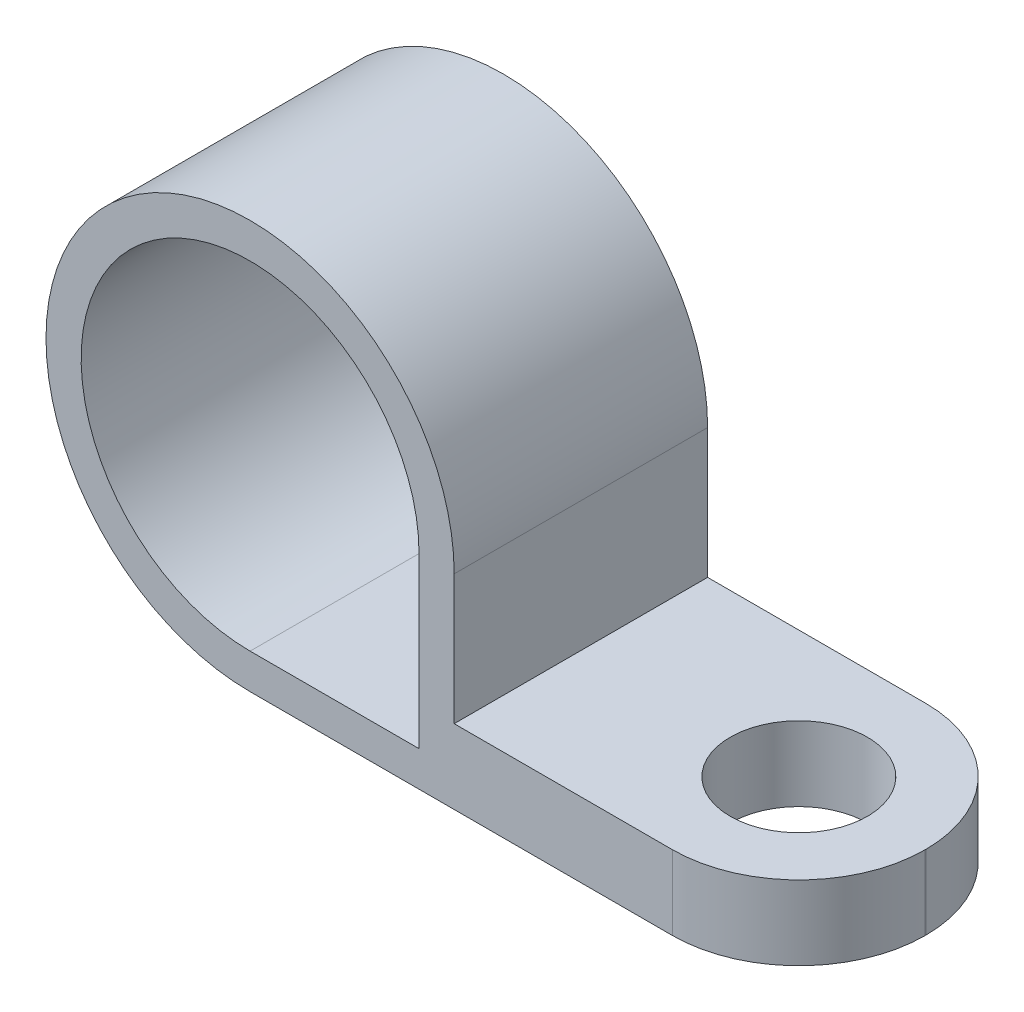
ISO-10303-21;
HEADER;
FILE_DESCRIPTION(('STEP AP214'),'2;1');
FILE_NAME('part.step','',(''),(''),'','','');
FILE_SCHEMA(('AUTOMOTIVE_DESIGN { 1 0 10303 214 1 1 1 1 }'));
ENDSEC;
DATA;
#1=APPLICATION_CONTEXT('core data for automotive mechanical design processes');
#2=APPLICATION_PROTOCOL_DEFINITION('international standard','automotive_design',2000,#1);
#3=PRODUCT_CONTEXT('',#1,'mechanical');
#4=PRODUCT('Part','Part','',(#3));
#5=PRODUCT_RELATED_PRODUCT_CATEGORY('part','',(#4));
#6=PRODUCT_DEFINITION_FORMATION('','',#4);
#7=PRODUCT_DEFINITION_CONTEXT('part definition',#1,'design');
#8=PRODUCT_DEFINITION('design','',#6,#7);
#9=PRODUCT_DEFINITION_SHAPE('','',#8);
#10=(LENGTH_UNIT() NAMED_UNIT(*) SI_UNIT(.MILLI.,.METRE.));
#11=(NAMED_UNIT(*) PLANE_ANGLE_UNIT() SI_UNIT($,.RADIAN.));
#12=(NAMED_UNIT(*) SI_UNIT($,.STERADIAN.) SOLID_ANGLE_UNIT());
#13=UNCERTAINTY_MEASURE_WITH_UNIT(LENGTH_MEASURE(1.E-05),#10,'distance_accuracy_value','');
#14=(GEOMETRIC_REPRESENTATION_CONTEXT(3) GLOBAL_UNCERTAINTY_ASSIGNED_CONTEXT((#13)) GLOBAL_UNIT_ASSIGNED_CONTEXT((#10,
#11,#12)) REPRESENTATION_CONTEXT('',''));
#15=CARTESIAN_POINT('',(0.,0.,0.));
#16=DIRECTION('',(0.,0.,1.));
#17=DIRECTION('',(1.,0.,0.));
#18=AXIS2_PLACEMENT_3D('',#15,#16,#17);
#19=CARTESIAN_POINT('',(0.,0.,4.7625));
#20=DIRECTION('',(0.,0.,1.));
#21=DIRECTION('',(1.,0.,0.));
#22=AXIS2_PLACEMENT_3D('',#19,#20,#21);
#23=PLANE('',#22);
#24=DIRECTION('',(1.,0.,0.));
#25=VECTOR('',#24,1.);
#26=CARTESIAN_POINT('',(0.,-7.6708,4.7625));
#27=LINE('',#26,#25);
#28=CARTESIAN_POINT('',(0.,-7.6708,4.7625));
#29=VERTEX_POINT('',#28);
#30=CARTESIAN_POINT('',(15.875,-7.6708,4.7625));
#31=VERTEX_POINT('',#30);
#32=EDGE_CURVE('E510',#29,#31,#27,.T.);
#33=ORIENTED_EDGE('',*,*,#32,.T.);
#34=DIRECTION('',(0.,1.,0.));
#35=VECTOR('',#34,1.);
#36=CARTESIAN_POINT('',(15.875,-4.8768,4.7625));
#37=LINE('',#36,#35);
#38=CARTESIAN_POINT('',(15.875,-4.8768,4.7625));
#39=VERTEX_POINT('',#38);
#40=EDGE_CURVE('E11',#31,#39,#37,.T.);
#41=ORIENTED_EDGE('',*,*,#40,.T.);
#42=DIRECTION('',(-1.,0.,0.));
#43=VECTOR('',#42,1.);
#44=CARTESIAN_POINT('',(7.6708,-4.8768,4.7625));
#45=LINE('',#44,#43);
#46=CARTESIAN_POINT('',(7.6708,-4.8768,4.7625));
#47=VERTEX_POINT('',#46);
#48=EDGE_CURVE('E512',#39,#47,#45,.T.);
#49=ORIENTED_EDGE('',*,*,#48,.T.);
#50=DIRECTION('',(0.,1.,0.));
#51=VECTOR('',#50,1.);
#52=CARTESIAN_POINT('',(7.6708,0.,4.7625));
#53=LINE('',#52,#51);
#54=CARTESIAN_POINT('',(7.6708,0.,4.7625));
#55=VERTEX_POINT('',#54);
#56=EDGE_CURVE('E514',#47,#55,#53,.T.);
#57=ORIENTED_EDGE('',*,*,#56,.T.);
#58=CARTESIAN_POINT('',(0.,0.,4.7625));
#59=DIRECTION('',(0.,0.,1.));
#60=DIRECTION('',(1.,0.,0.));
#61=AXIS2_PLACEMENT_3D('',#58,#59,#60);
#62=CIRCLE('',#61,7.6708);
#63=EDGE_CURVE('E507',#55,#29,#62,.T.);
#64=ORIENTED_EDGE('',*,*,#63,.T.);
#65=EDGE_LOOP('',(#33,#41,#49,#57,#64));
#66=FACE_BOUND('',#65,.T.);
#67=DIRECTION('',(1.,0.,0.));
#68=VECTOR('',#67,1.);
#69=CARTESIAN_POINT('',(6.35,-6.35,4.7625));
#70=LINE('',#69,#68);
#71=CARTESIAN_POINT('',(0.,-6.35,4.7625));
#72=VERTEX_POINT('',#71);
#73=CARTESIAN_POINT('',(6.35,-6.35,4.7625));
#74=VERTEX_POINT('',#73);
#75=EDGE_CURVE('E492',#72,#74,#70,.T.);
#76=ORIENTED_EDGE('',*,*,#75,.F.);
#77=CARTESIAN_POINT('',(0.,0.,4.7625));
#78=DIRECTION('',(0.,0.,1.));
#79=DIRECTION('',(1.,0.,0.));
#80=AXIS2_PLACEMENT_3D('',#77,#78,#79);
#81=CIRCLE('',#80,6.35);
#82=CARTESIAN_POINT('',(6.35,0.,4.7625));
#83=VERTEX_POINT('',#82);
#84=EDGE_CURVE('E479',#83,#72,#81,.T.);
#85=ORIENTED_EDGE('',*,*,#84,.F.);
#86=DIRECTION('',(0.,1.,0.));
#87=VECTOR('',#86,1.);
#88=CARTESIAN_POINT('',(6.35,0.,4.7625));
#89=LINE('',#88,#87);
#90=EDGE_CURVE('E494',#74,#83,#89,.T.);
#91=ORIENTED_EDGE('',*,*,#90,.F.);
#92=EDGE_LOOP('',(#76,#85,#91));
#93=FACE_BOUND('',#92,.T.);
#94=ADVANCED_FACE('F381',(#66,#93),#23,.T.);
#95=CARTESIAN_POINT('',(0.,0.,-4.7625));
#96=DIRECTION('',(0.,0.,1.));
#97=DIRECTION('',(1.,0.,0.));
#98=AXIS2_PLACEMENT_3D('',#95,#96,#97);
#99=PLANE('',#98);
#100=DIRECTION('',(-1.,0.,0.));
#101=VECTOR('',#100,1.);
#102=CARTESIAN_POINT('',(7.6708,-4.8768,-4.7625));
#103=LINE('',#102,#101);
#104=CARTESIAN_POINT('',(15.875,-4.8768,-4.7625));
#105=VERTEX_POINT('',#104);
#106=CARTESIAN_POINT('',(7.6708,-4.8768,-4.7625));
#107=VERTEX_POINT('',#106);
#108=EDGE_CURVE('E503',#105,#107,#103,.T.);
#109=ORIENTED_EDGE('',*,*,#108,.F.);
#110=DIRECTION('',(0.,1.,0.));
#111=VECTOR('',#110,1.);
#112=CARTESIAN_POINT('',(15.875,0.,-4.7625));
#113=LINE('',#112,#111);
#114=CARTESIAN_POINT('',(15.875,-7.6708,-4.7625));
#115=VERTEX_POINT('',#114);
#116=EDGE_CURVE('E404',#105,#115,#113,.F.);
#117=ORIENTED_EDGE('',*,*,#116,.T.);
#118=DIRECTION('',(1.,0.,0.));
#119=VECTOR('',#118,1.);
#120=CARTESIAN_POINT('',(0.,-7.6708,-4.7625));
#121=LINE('',#120,#119);
#122=CARTESIAN_POINT('',(0.,-7.6708,-4.7625));
#123=VERTEX_POINT('',#122);
#124=EDGE_CURVE('E501',#123,#115,#121,.T.);
#125=ORIENTED_EDGE('',*,*,#124,.F.);
#126=CARTESIAN_POINT('',(0.,0.,-4.7625));
#127=DIRECTION('',(0.,0.,1.));
#128=DIRECTION('',(1.,0.,0.));
#129=AXIS2_PLACEMENT_3D('',#126,#127,#128);
#130=CIRCLE('',#129,7.6708);
#131=CARTESIAN_POINT('',(7.6708,0.,-4.7625));
#132=VERTEX_POINT('',#131);
#133=EDGE_CURVE('E480',#132,#123,#130,.T.);
#134=ORIENTED_EDGE('',*,*,#133,.F.);
#135=DIRECTION('',(0.,1.,0.));
#136=VECTOR('',#135,1.);
#137=CARTESIAN_POINT('',(7.6708,0.,-4.7625));
#138=LINE('',#137,#136);
#139=EDGE_CURVE('E505',#107,#132,#138,.T.);
#140=ORIENTED_EDGE('',*,*,#139,.F.);
#141=EDGE_LOOP('',(#109,#117,#125,#134,#140));
#142=FACE_BOUND('',#141,.T.);
#143=CARTESIAN_POINT('',(0.,0.,-4.7625));
#144=DIRECTION('',(0.,0.,1.));
#145=DIRECTION('',(1.,0.,0.));
#146=AXIS2_PLACEMENT_3D('',#143,#144,#145);
#147=CIRCLE('',#146,6.35);
#148=CARTESIAN_POINT('',(6.35,0.,-4.7625));
#149=VERTEX_POINT('',#148);
#150=CARTESIAN_POINT('',(0.,-6.35,-4.7625));
#151=VERTEX_POINT('',#150);
#152=EDGE_CURVE('E472',#149,#151,#147,.T.);
#153=ORIENTED_EDGE('',*,*,#152,.T.);
#154=DIRECTION('',(1.,0.,0.));
#155=VECTOR('',#154,1.);
#156=CARTESIAN_POINT('',(6.35,-6.35,-4.7625));
#157=LINE('',#156,#155);
#158=CARTESIAN_POINT('',(6.35,-6.35,-4.7625));
#159=VERTEX_POINT('',#158);
#160=EDGE_CURVE('E460',#151,#159,#157,.T.);
#161=ORIENTED_EDGE('',*,*,#160,.T.);
#162=DIRECTION('',(0.,1.,0.));
#163=VECTOR('',#162,1.);
#164=CARTESIAN_POINT('',(6.35,0.,-4.7625));
#165=LINE('',#164,#163);
#166=EDGE_CURVE('E471',#159,#149,#165,.T.);
#167=ORIENTED_EDGE('',*,*,#166,.T.);
#168=EDGE_LOOP('',(#153,#161,#167));
#169=FACE_BOUND('',#168,.T.);
#170=ADVANCED_FACE('F482',(#142,#169),#99,.F.);
#171=CARTESIAN_POINT('',(0.,0.,4.7625));
#172=DIRECTION('',(0.,0.,-1.));
#173=DIRECTION('',(-1.,0.,0.));
#174=AXIS2_PLACEMENT_3D('',#171,#172,#173);
#175=CYLINDRICAL_SURFACE('',#174,7.6708);
#176=ORIENTED_EDGE('',*,*,#133,.T.);
#177=DIRECTION('',(0.,0.,-1.));
#178=VECTOR('',#177,1.);
#179=CARTESIAN_POINT('',(0.,-7.6708,4.7625));
#180=LINE('',#179,#178);
#181=EDGE_CURVE('E528',#29,#123,#180,.T.);
#182=ORIENTED_EDGE('',*,*,#181,.F.);
#183=ORIENTED_EDGE('',*,*,#63,.F.);
#184=DIRECTION('',(0.,0.,-1.));
#185=VECTOR('',#184,1.);
#186=CARTESIAN_POINT('',(7.6708,0.,4.7625));
#187=LINE('',#186,#185);
#188=EDGE_CURVE('E516',#55,#132,#187,.T.);
#189=ORIENTED_EDGE('',*,*,#188,.T.);
#190=EDGE_LOOP('',(#176,#182,#183,#189));
#191=FACE_BOUND('',#190,.T.);
#192=ADVANCED_FACE('F383',(#191),#175,.T.);
#193=CARTESIAN_POINT('',(0.,-7.6708,4.7625));
#194=DIRECTION('',(0.,1.,0.));
#195=DIRECTION('',(0.,0.,1.));
#196=AXIS2_PLACEMENT_3D('',#193,#194,#195);
#197=PLANE('',#196);
#198=CARTESIAN_POINT('',(15.875,-7.6708,0.0127));
#199=DIRECTION('',(0.,1.,0.));
#200=DIRECTION('',(0.,0.,1.));
#201=AXIS2_PLACEMENT_3D('',#198,#199,#200);
#202=CIRCLE('',#201,2.5781);
#203=CARTESIAN_POINT('',(15.875,-7.6708,2.5908));
#204=VERTEX_POINT('',#203);
#205=EDGE_CURVE('E483',#204,#204,#202,.T.);
#206=ORIENTED_EDGE('',*,*,#205,.T.);
#207=EDGE_LOOP('',(#206));
#208=FACE_BOUND('',#207,.T.);
#209=ORIENTED_EDGE('',*,*,#124,.T.);
#210=CARTESIAN_POINT('',(15.875,-7.6708,-0.0127));
#211=DIRECTION('',(0.,1.,0.));
#212=DIRECTION('',(0.,0.,1.));
#213=AXIS2_PLACEMENT_3D('',#210,#211,#212);
#214=CIRCLE('',#213,4.7498);
#215=CARTESIAN_POINT('',(20.6248,-7.6708,-0.0126999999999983));
#216=VERTEX_POINT('',#215);
#217=EDGE_CURVE('E389',#115,#216,#214,.F.);
#218=ORIENTED_EDGE('',*,*,#217,.T.);
#219=DIRECTION('',(0.,0.,-1.));
#220=VECTOR('',#219,1.);
#221=CARTESIAN_POINT('',(20.6248,-7.6708,4.7625));
#222=LINE('',#221,#220);
#223=CARTESIAN_POINT('',(20.6248,-7.6708,0.0127000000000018));
#224=VERTEX_POINT('',#223);
#225=EDGE_CURVE('E525',#224,#216,#222,.T.);
#226=ORIENTED_EDGE('',*,*,#225,.F.);
#227=CARTESIAN_POINT('',(15.875,-7.6708,0.0127));
#228=DIRECTION('',(0.,1.,0.));
#229=DIRECTION('',(0.,0.,1.));
#230=AXIS2_PLACEMENT_3D('',#227,#228,#229);
#231=CIRCLE('',#230,4.7498);
#232=EDGE_CURVE('E396',#224,#31,#231,.F.);
#233=ORIENTED_EDGE('',*,*,#232,.T.);
#234=ORIENTED_EDGE('',*,*,#32,.F.);
#235=ORIENTED_EDGE('',*,*,#181,.T.);
#236=EDGE_LOOP('',(#209,#218,#226,#233,#234,#235));
#237=FACE_BOUND('',#236,.T.);
#238=ADVANCED_FACE('F542',(#208,#237),#197,.F.);
#239=CARTESIAN_POINT('',(20.6248,-4.8768,4.7625));
#240=DIRECTION('',(-1.,0.,0.));
#241=DIRECTION('',(0.,0.,1.));
#242=AXIS2_PLACEMENT_3D('',#239,#240,#241);
#243=PLANE('',#242);
#244=ORIENTED_EDGE('',*,*,#225,.T.);
#245=DIRECTION('',(0.,1.,0.));
#246=VECTOR('',#245,1.);
#247=CARTESIAN_POINT('',(20.6248,-4.8768,-0.0127));
#248=LINE('',#247,#246);
#249=CARTESIAN_POINT('',(20.6248,-4.8768,-0.0126999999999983));
#250=VERTEX_POINT('',#249);
#251=EDGE_CURVE('E533',#216,#250,#248,.T.);
#252=ORIENTED_EDGE('',*,*,#251,.T.);
#253=DIRECTION('',(0.,0.,-1.));
#254=VECTOR('',#253,1.);
#255=CARTESIAN_POINT('',(20.6248,-4.8768,4.7625));
#256=LINE('',#255,#254);
#257=CARTESIAN_POINT('',(20.6248,-4.8768,0.0127000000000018));
#258=VERTEX_POINT('',#257);
#259=EDGE_CURVE('E522',#258,#250,#256,.T.);
#260=ORIENTED_EDGE('',*,*,#259,.F.);
#261=DIRECTION('',(0.,1.,0.));
#262=VECTOR('',#261,1.);
#263=CARTESIAN_POINT('',(20.6248,-7.6708,0.0127));
#264=LINE('',#263,#262);
#265=EDGE_CURVE('E531',#258,#224,#264,.F.);
#266=ORIENTED_EDGE('',*,*,#265,.T.);
#267=EDGE_LOOP('',(#244,#252,#260,#266));
#268=FACE_BOUND('',#267,.T.);
#269=ADVANCED_FACE('F546',(#268),#243,.F.);
#270=CARTESIAN_POINT('',(7.6708,-4.8768,4.7625));
#271=DIRECTION('',(0.,-1.,0.));
#272=DIRECTION('',(1.,0.,0.));
#273=AXIS2_PLACEMENT_3D('',#270,#271,#272);
#274=PLANE('',#273);
#275=CARTESIAN_POINT('',(15.875,-4.8768,0.0127));
#276=DIRECTION('',(0.,1.,0.));
#277=DIRECTION('',(0.,0.,1.));
#278=AXIS2_PLACEMENT_3D('',#275,#276,#277);
#279=CIRCLE('',#278,2.5781);
#280=CARTESIAN_POINT('',(15.875,-4.8768,2.5908));
#281=VERTEX_POINT('',#280);
#282=EDGE_CURVE('E486',#281,#281,#279,.T.);
#283=ORIENTED_EDGE('',*,*,#282,.F.);
#284=EDGE_LOOP('',(#283));
#285=FACE_BOUND('',#284,.T.);
#286=ORIENTED_EDGE('',*,*,#259,.T.);
#287=CARTESIAN_POINT('',(15.875,-4.8768,-0.0127));
#288=DIRECTION('',(0.,-1.,0.));
#289=DIRECTION('',(1.,0.,0.));
#290=AXIS2_PLACEMENT_3D('',#287,#288,#289);
#291=CIRCLE('',#290,4.7498);
#292=EDGE_CURVE('E538',#250,#105,#291,.F.);
#293=ORIENTED_EDGE('',*,*,#292,.T.);
#294=ORIENTED_EDGE('',*,*,#108,.T.);
#295=DIRECTION('',(0.,0.,-1.));
#296=VECTOR('',#295,1.);
#297=CARTESIAN_POINT('',(7.6708,-4.8768,4.7625));
#298=LINE('',#297,#296);
#299=EDGE_CURVE('E519',#47,#107,#298,.T.);
#300=ORIENTED_EDGE('',*,*,#299,.F.);
#301=ORIENTED_EDGE('',*,*,#48,.F.);
#302=CARTESIAN_POINT('',(15.875,-4.8768,0.0127));
#303=DIRECTION('',(0.,-1.,0.));
#304=DIRECTION('',(1.,0.,0.));
#305=AXIS2_PLACEMENT_3D('',#302,#303,#304);
#306=CIRCLE('',#305,4.7498);
#307=EDGE_CURVE('E536',#39,#258,#306,.F.);
#308=ORIENTED_EDGE('',*,*,#307,.T.);
#309=EDGE_LOOP('',(#286,#293,#294,#300,#301,#308));
#310=FACE_BOUND('',#309,.T.);
#311=ADVANCED_FACE('F551',(#285,#310),#274,.F.);
#312=CARTESIAN_POINT('',(7.6708,0.,4.7625));
#313=DIRECTION('',(-1.,0.,0.));
#314=DIRECTION('',(0.,-1.,0.));
#315=AXIS2_PLACEMENT_3D('',#312,#313,#314);
#316=PLANE('',#315);
#317=ORIENTED_EDGE('',*,*,#139,.T.);
#318=ORIENTED_EDGE('',*,*,#188,.F.);
#319=ORIENTED_EDGE('',*,*,#56,.F.);
#320=ORIENTED_EDGE('',*,*,#299,.T.);
#321=EDGE_LOOP('',(#317,#318,#319,#320));
#322=FACE_BOUND('',#321,.T.);
#323=ADVANCED_FACE('F557',(#322),#316,.F.);
#324=CARTESIAN_POINT('',(0.,0.,4.7625));
#325=DIRECTION('',(0.,0.,-1.));
#326=DIRECTION('',(-1.,0.,0.));
#327=AXIS2_PLACEMENT_3D('',#324,#325,#326);
#328=CYLINDRICAL_SURFACE('',#327,6.35);
#329=ORIENTED_EDGE('',*,*,#152,.F.);
#330=DIRECTION('',(0.,0.,-1.));
#331=VECTOR('',#330,1.);
#332=CARTESIAN_POINT('',(6.35,0.,4.7625));
#333=LINE('',#332,#331);
#334=EDGE_CURVE('E496',#83,#149,#333,.T.);
#335=ORIENTED_EDGE('',*,*,#334,.F.);
#336=ORIENTED_EDGE('',*,*,#84,.T.);
#337=DIRECTION('',(0.,0.,-1.));
#338=VECTOR('',#337,1.);
#339=CARTESIAN_POINT('',(0.,-6.35,4.7625));
#340=LINE('',#339,#338);
#341=EDGE_CURVE('E464',#72,#151,#340,.T.);
#342=ORIENTED_EDGE('',*,*,#341,.T.);
#343=EDGE_LOOP('',(#329,#335,#336,#342));
#344=FACE_BOUND('',#343,.T.);
#345=ADVANCED_FACE('F475',(#344),#328,.F.);
#346=CARTESIAN_POINT('',(6.35,-6.35,4.7625));
#347=DIRECTION('',(0.,1.,0.));
#348=DIRECTION('',(-1.,0.,0.));
#349=AXIS2_PLACEMENT_3D('',#346,#347,#348);
#350=PLANE('',#349);
#351=ORIENTED_EDGE('',*,*,#160,.F.);
#352=ORIENTED_EDGE('',*,*,#341,.F.);
#353=ORIENTED_EDGE('',*,*,#75,.T.);
#354=DIRECTION('',(0.,0.,-1.));
#355=VECTOR('',#354,1.);
#356=CARTESIAN_POINT('',(6.35,-6.35,4.7625));
#357=LINE('',#356,#355);
#358=EDGE_CURVE('E466',#74,#159,#357,.T.);
#359=ORIENTED_EDGE('',*,*,#358,.T.);
#360=EDGE_LOOP('',(#351,#352,#353,#359));
#361=FACE_BOUND('',#360,.T.);
#362=ADVANCED_FACE('F462',(#361),#350,.T.);
#363=CARTESIAN_POINT('',(6.35,0.,4.7625));
#364=DIRECTION('',(-1.,0.,0.));
#365=DIRECTION('',(0.,-1.,0.));
#366=AXIS2_PLACEMENT_3D('',#363,#364,#365);
#367=PLANE('',#366);
#368=ORIENTED_EDGE('',*,*,#166,.F.);
#369=ORIENTED_EDGE('',*,*,#358,.F.);
#370=ORIENTED_EDGE('',*,*,#90,.T.);
#371=ORIENTED_EDGE('',*,*,#334,.T.);
#372=EDGE_LOOP('',(#368,#369,#370,#371));
#373=FACE_BOUND('',#372,.T.);
#374=ADVANCED_FACE('F578',(#373),#367,.T.);
#375=CARTESIAN_POINT('',(15.875,-4.8768,-0.0127));
#376=DIRECTION('',(0.,1.,0.));
#377=DIRECTION('',(0.,0.,1.));
#378=AXIS2_PLACEMENT_3D('',#375,#376,#377);
#379=CYLINDRICAL_SURFACE('',#378,4.7498);
#380=ORIENTED_EDGE('',*,*,#217,.F.);
#381=ORIENTED_EDGE('',*,*,#116,.F.);
#382=ORIENTED_EDGE('',*,*,#292,.F.);
#383=ORIENTED_EDGE('',*,*,#251,.F.);
#384=EDGE_LOOP('',(#380,#381,#382,#383));
#385=FACE_BOUND('',#384,.T.);
#386=ADVANCED_FACE('F549',(#385),#379,.T.);
#387=CARTESIAN_POINT('',(15.875,0.,0.0127));
#388=DIRECTION('',(0.,-1.,0.));
#389=DIRECTION('',(0.,0.,-1.));
#390=AXIS2_PLACEMENT_3D('',#387,#388,#389);
#391=CYLINDRICAL_SURFACE('',#390,4.7498);
#392=ORIENTED_EDGE('',*,*,#232,.F.);
#393=ORIENTED_EDGE('',*,*,#265,.F.);
#394=ORIENTED_EDGE('',*,*,#307,.F.);
#395=ORIENTED_EDGE('',*,*,#40,.F.);
#396=EDGE_LOOP('',(#392,#393,#394,#395));
#397=FACE_BOUND('',#396,.T.);
#398=ADVANCED_FACE('F567',(#397),#391,.T.);
#399=CARTESIAN_POINT('',(15.875,-7.6708,0.0127));
#400=DIRECTION('',(0.,1.,0.));
#401=DIRECTION('',(0.,0.,1.));
#402=AXIS2_PLACEMENT_3D('',#399,#400,#401);
#403=CYLINDRICAL_SURFACE('',#402,2.5781);
#404=ORIENTED_EDGE('',*,*,#205,.F.);
#405=EDGE_LOOP('',(#404));
#406=FACE_BOUND('',#405,.T.);
#407=ORIENTED_EDGE('',*,*,#282,.T.);
#408=EDGE_LOOP('',(#407));
#409=FACE_BOUND('',#408,.T.);
#410=ADVANCED_FACE('F569',(#406,#409),#403,.F.);
#411=CLOSED_SHELL('',(#94,#170,#192,#238,#269,#311,#323,#345,#362,#374,#386,#398,#410));
#412=MANIFOLD_SOLID_BREP('B2',#411);
#413=ADVANCED_BREP_SHAPE_REPRESENTATION('',(#18,#412),#14);
#414=SHAPE_DEFINITION_REPRESENTATION(#9,#413);
ENDSEC;
END-ISO-10303-21;
